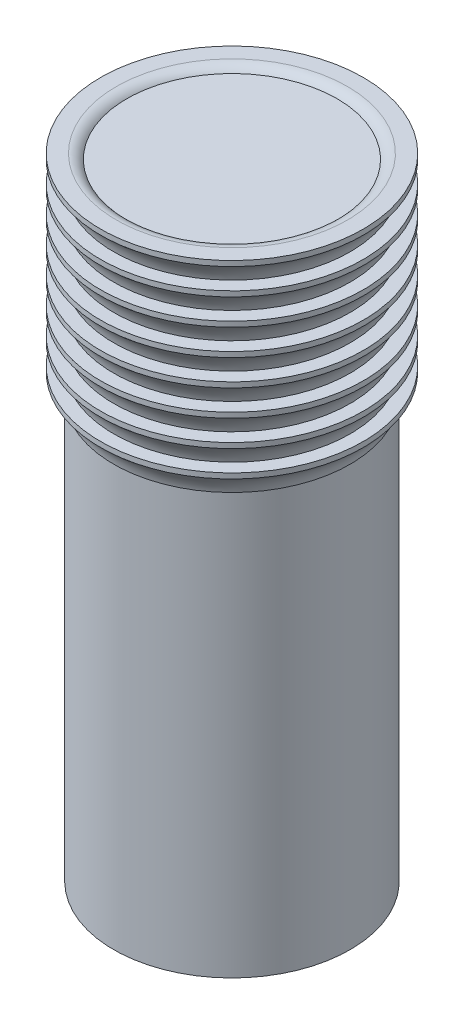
ISO-10303-21;
HEADER;
FILE_DESCRIPTION(('STEP AP214'),'2;1');
FILE_NAME('part.step','',(''),(''),'','','');
FILE_SCHEMA(('AUTOMOTIVE_DESIGN { 1 0 10303 214 1 1 1 1 }'));
ENDSEC;
DATA;
#1=APPLICATION_CONTEXT('core data for automotive mechanical design processes');
#2=APPLICATION_PROTOCOL_DEFINITION('international standard','automotive_design',2000,#1);
#3=PRODUCT_CONTEXT('',#1,'mechanical');
#4=PRODUCT('Part','Part','',(#3));
#5=PRODUCT_RELATED_PRODUCT_CATEGORY('part','',(#4));
#6=PRODUCT_DEFINITION_FORMATION('','',#4);
#7=PRODUCT_DEFINITION_CONTEXT('part definition',#1,'design');
#8=PRODUCT_DEFINITION('design','',#6,#7);
#9=PRODUCT_DEFINITION_SHAPE('','',#8);
#10=(LENGTH_UNIT() NAMED_UNIT(*) SI_UNIT(.MILLI.,.METRE.));
#11=(NAMED_UNIT(*) PLANE_ANGLE_UNIT() SI_UNIT($,.RADIAN.));
#12=(NAMED_UNIT(*) SI_UNIT($,.STERADIAN.) SOLID_ANGLE_UNIT());
#13=UNCERTAINTY_MEASURE_WITH_UNIT(LENGTH_MEASURE(1.E-05),#10,'distance_accuracy_value','');
#14=(GEOMETRIC_REPRESENTATION_CONTEXT(3) GLOBAL_UNCERTAINTY_ASSIGNED_CONTEXT((#13)) GLOBAL_UNIT_ASSIGNED_CONTEXT((#10,
#11,#12)) REPRESENTATION_CONTEXT('',''));
#15=CARTESIAN_POINT('',(0.,0.,0.));
#16=DIRECTION('',(0.,0.,1.));
#17=DIRECTION('',(1.,0.,0.));
#18=AXIS2_PLACEMENT_3D('',#15,#16,#17);
#19=CARTESIAN_POINT('',(0.,-85.,0.));
#20=DIRECTION('',(0.,1.,0.));
#21=DIRECTION('',(0.,0.,1.));
#22=AXIS2_PLACEMENT_3D('',#19,#20,#21);
#23=CYLINDRICAL_SURFACE('',#22,22.5);
#24=CARTESIAN_POINT('',(0.,-85.,0.));
#25=DIRECTION('',(0.,-1.,0.));
#26=DIRECTION('',(0.,0.,-1.));
#27=AXIS2_PLACEMENT_3D('',#24,#25,#26);
#28=CIRCLE('',#27,22.5);
#29=CARTESIAN_POINT('',(0.,-85.,-22.5));
#30=VERTEX_POINT('',#29);
#31=EDGE_CURVE('E11',#30,#30,#28,.T.);
#32=ORIENTED_EDGE('',*,*,#31,.F.);
#33=EDGE_LOOP('',(#32));
#34=FACE_BOUND('',#33,.T.);
#35=CARTESIAN_POINT('',(0.,-5.,0.));
#36=DIRECTION('',(0.,-1.,0.));
#37=DIRECTION('',(0.,0.,-1.));
#38=AXIS2_PLACEMENT_3D('',#35,#36,#37);
#39=CIRCLE('',#38,22.5);
#40=CARTESIAN_POINT('',(0.,-5.,-22.5));
#41=VERTEX_POINT('',#40);
#42=EDGE_CURVE('E55',#41,#41,#39,.T.);
#43=ORIENTED_EDGE('',*,*,#42,.T.);
#44=EDGE_LOOP('',(#43));
#45=FACE_BOUND('',#44,.T.);
#46=ADVANCED_FACE('F52',(#34,#45),#23,.T.);
#47=CARTESIAN_POINT('',(0.,-85.,0.));
#48=DIRECTION('',(0.,-1.,0.));
#49=DIRECTION('',(0.,0.,-1.));
#50=AXIS2_PLACEMENT_3D('',#47,#48,#49);
#51=PLANE('',#50);
#52=ORIENTED_EDGE('',*,*,#31,.T.);
#53=EDGE_LOOP('',(#52));
#54=FACE_BOUND('',#53,.T.);
#55=ADVANCED_FACE('F69',(#54),#51,.T.);
#56=CARTESIAN_POINT('',(0.,-5.,0.));
#57=DIRECTION('',(0.,-1.,0.));
#58=DIRECTION('',(0.,0.,-1.));
#59=AXIS2_PLACEMENT_3D('',#56,#57,#58);
#60=PLANE('',#59);
#61=ORIENTED_EDGE('',*,*,#42,.F.);
#62=EDGE_LOOP('',(#61));
#63=FACE_BOUND('',#62,.T.);
#64=ADVANCED_FACE('F67',(#63),#60,.F.);
#65=CLOSED_SHELL('',(#46,#55,#64));
#66=MANIFOLD_SOLID_BREP('B2',#65);
#67=CARTESIAN_POINT('',(0.,-6.34151617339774,0.));
#68=DIRECTION('',(0.,-1.,0.));
#69=DIRECTION('',(0.,0.,-1.));
#70=AXIS2_PLACEMENT_3D('',#67,#68,#69);
#71=TOROIDAL_SURFACE('',#70,29.0964258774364,6.73145600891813);
#72=CARTESIAN_POINT('',(0.,-1.,0.));
#73=DIRECTION('',(0.,-1.,0.));
#74=DIRECTION('',(0.,0.,-1.));
#75=AXIS2_PLACEMENT_3D('',#72,#73,#74);
#76=CIRCLE('',#75,25.);
#77=CARTESIAN_POINT('',(0.,-1.,-25.));
#78=VERTEX_POINT('',#77);
#79=EDGE_CURVE('E115',#78,#78,#76,.T.);
#80=ORIENTED_EDGE('',*,*,#79,.T.);
#81=EDGE_LOOP('',(#80));
#82=FACE_BOUND('',#81,.T.);
#83=CARTESIAN_POINT('',(0.,-5.,0.));
#84=DIRECTION('',(0.,-1.,0.));
#85=DIRECTION('',(0.,0.,-1.));
#86=AXIS2_PLACEMENT_3D('',#83,#84,#85);
#87=CIRCLE('',#86,22.5);
#88=CARTESIAN_POINT('',(0.,-5.,-22.5));
#89=VERTEX_POINT('',#88);
#90=EDGE_CURVE('E107',#89,#89,#87,.T.);
#91=ORIENTED_EDGE('',*,*,#90,.F.);
#92=EDGE_LOOP('',(#91));
#93=FACE_BOUND('',#92,.T.);
#94=ADVANCED_FACE('F100',(#82,#93),#71,.F.);
#95=CARTESIAN_POINT('',(0.,-5.,0.));
#96=DIRECTION('',(0.,1.,0.));
#97=DIRECTION('',(0.,0.,1.));
#98=AXIS2_PLACEMENT_3D('',#95,#96,#97);
#99=PLANE('',#98);
#100=ORIENTED_EDGE('',*,*,#90,.T.);
#101=EDGE_LOOP('',(#100));
#102=FACE_BOUND('',#101,.T.);
#103=ADVANCED_FACE('F197',(#102),#99,.F.);
#104=CARTESIAN_POINT('',(0.,0.,0.));
#105=DIRECTION('',(0.,-1.,0.));
#106=DIRECTION('',(0.,0.,-1.));
#107=AXIS2_PLACEMENT_3D('',#104,#105,#106);
#108=PLANE('',#107);
#109=CARTESIAN_POINT('',(0.,0.,0.));
#110=DIRECTION('',(0.,-1.,0.));
#111=DIRECTION('',(0.,0.,-1.));
#112=AXIS2_PLACEMENT_3D('',#109,#110,#111);
#113=CIRCLE('',#112,22.5);
#114=CARTESIAN_POINT('',(0.,0.,-22.5));
#115=VERTEX_POINT('',#114);
#116=EDGE_CURVE('E120',#115,#115,#113,.T.);
#117=ORIENTED_EDGE('',*,*,#116,.T.);
#118=EDGE_LOOP('',(#117));
#119=FACE_BOUND('',#118,.T.);
#120=CARTESIAN_POINT('',(0.,0.,0.));
#121=DIRECTION('',(0.,-1.,0.));
#122=DIRECTION('',(0.,0.,-1.));
#123=AXIS2_PLACEMENT_3D('',#120,#121,#122);
#124=CIRCLE('',#123,25.);
#125=CARTESIAN_POINT('',(0.,0.,-25.));
#126=VERTEX_POINT('',#125);
#127=EDGE_CURVE('E111',#126,#126,#124,.T.);
#128=ORIENTED_EDGE('',*,*,#127,.F.);
#129=EDGE_LOOP('',(#128));
#130=FACE_BOUND('',#129,.T.);
#131=ADVANCED_FACE('F202',(#119,#130),#108,.F.);
#132=CARTESIAN_POINT('',(0.,-5.,0.));
#133=DIRECTION('',(0.,-1.,0.));
#134=DIRECTION('',(0.,0.,-1.));
#135=AXIS2_PLACEMENT_3D('',#132,#133,#134);
#136=CYLINDRICAL_SURFACE('',#135,25.);
#137=ORIENTED_EDGE('',*,*,#79,.F.);
#138=EDGE_LOOP('',(#137));
#139=FACE_BOUND('',#138,.T.);
#140=ORIENTED_EDGE('',*,*,#127,.T.);
#141=EDGE_LOOP('',(#140));
#142=FACE_BOUND('',#141,.T.);
#143=ADVANCED_FACE('F208',(#139,#142),#136,.T.);
#144=CARTESIAN_POINT('',(0.,-1.34151617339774,0.));
#145=DIRECTION('',(0.,-1.,0.));
#146=DIRECTION('',(0.,0.,-1.));
#147=AXIS2_PLACEMENT_3D('',#144,#145,#146);
#148=TOROIDAL_SURFACE('',#147,29.0964258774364,6.73145600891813);
#149=CARTESIAN_POINT('',(0.,4.,0.));
#150=DIRECTION('',(0.,-1.,0.));
#151=DIRECTION('',(0.,0.,-1.));
#152=AXIS2_PLACEMENT_3D('',#149,#150,#151);
#153=CIRCLE('',#152,25.);
#154=CARTESIAN_POINT('',(0.,4.,-25.));
#155=VERTEX_POINT('',#154);
#156=EDGE_CURVE('E126',#155,#155,#153,.T.);
#157=ORIENTED_EDGE('',*,*,#156,.T.);
#158=EDGE_LOOP('',(#157));
#159=FACE_BOUND('',#158,.T.);
#160=ORIENTED_EDGE('',*,*,#116,.F.);
#161=EDGE_LOOP('',(#160));
#162=FACE_BOUND('',#161,.T.);
#163=ADVANCED_FACE('F212',(#159,#162),#148,.F.);
#164=CARTESIAN_POINT('',(0.,5.,0.));
#165=DIRECTION('',(0.,-1.,0.));
#166=DIRECTION('',(0.,0.,-1.));
#167=AXIS2_PLACEMENT_3D('',#164,#165,#166);
#168=PLANE('',#167);
#169=CARTESIAN_POINT('',(0.,5.,0.));
#170=DIRECTION('',(0.,-1.,0.));
#171=DIRECTION('',(0.,0.,-1.));
#172=AXIS2_PLACEMENT_3D('',#169,#170,#171);
#173=CIRCLE('',#172,22.5);
#174=CARTESIAN_POINT('',(0.,5.,-22.5));
#175=VERTEX_POINT('',#174);
#176=EDGE_CURVE('E129',#175,#175,#173,.T.);
#177=ORIENTED_EDGE('',*,*,#176,.T.);
#178=EDGE_LOOP('',(#177));
#179=FACE_BOUND('',#178,.T.);
#180=CARTESIAN_POINT('',(0.,5.,0.));
#181=DIRECTION('',(0.,-1.,0.));
#182=DIRECTION('',(0.,0.,-1.));
#183=AXIS2_PLACEMENT_3D('',#180,#181,#182);
#184=CIRCLE('',#183,25.);
#185=CARTESIAN_POINT('',(0.,5.,-25.));
#186=VERTEX_POINT('',#185);
#187=EDGE_CURVE('E123',#186,#186,#184,.T.);
#188=ORIENTED_EDGE('',*,*,#187,.F.);
#189=EDGE_LOOP('',(#188));
#190=FACE_BOUND('',#189,.T.);
#191=ADVANCED_FACE('F216',(#179,#190),#168,.F.);
#192=CARTESIAN_POINT('',(0.,0.,0.));
#193=DIRECTION('',(0.,-1.,0.));
#194=DIRECTION('',(0.,0.,-1.));
#195=AXIS2_PLACEMENT_3D('',#192,#193,#194);
#196=CYLINDRICAL_SURFACE('',#195,25.);
#197=ORIENTED_EDGE('',*,*,#156,.F.);
#198=EDGE_LOOP('',(#197));
#199=FACE_BOUND('',#198,.T.);
#200=ORIENTED_EDGE('',*,*,#187,.T.);
#201=EDGE_LOOP('',(#200));
#202=FACE_BOUND('',#201,.T.);
#203=ADVANCED_FACE('F220',(#199,#202),#196,.T.);
#204=CARTESIAN_POINT('',(0.,3.65848382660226,0.));
#205=DIRECTION('',(0.,-1.,0.));
#206=DIRECTION('',(0.,0.,-1.));
#207=AXIS2_PLACEMENT_3D('',#204,#205,#206);
#208=TOROIDAL_SURFACE('',#207,29.0964258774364,6.73145600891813);
#209=CARTESIAN_POINT('',(0.,9.,0.));
#210=DIRECTION('',(0.,-1.,0.));
#211=DIRECTION('',(0.,0.,-1.));
#212=AXIS2_PLACEMENT_3D('',#209,#210,#211);
#213=CIRCLE('',#212,25.);
#214=CARTESIAN_POINT('',(0.,9.,-25.));
#215=VERTEX_POINT('',#214);
#216=EDGE_CURVE('E135',#215,#215,#213,.T.);
#217=ORIENTED_EDGE('',*,*,#216,.T.);
#218=EDGE_LOOP('',(#217));
#219=FACE_BOUND('',#218,.T.);
#220=ORIENTED_EDGE('',*,*,#176,.F.);
#221=EDGE_LOOP('',(#220));
#222=FACE_BOUND('',#221,.T.);
#223=ADVANCED_FACE('F224',(#219,#222),#208,.F.);
#224=CARTESIAN_POINT('',(0.,10.,0.));
#225=DIRECTION('',(0.,-1.,0.));
#226=DIRECTION('',(0.,0.,-1.));
#227=AXIS2_PLACEMENT_3D('',#224,#225,#226);
#228=PLANE('',#227);
#229=CARTESIAN_POINT('',(0.,9.99999999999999,0.));
#230=DIRECTION('',(0.,-1.,0.));
#231=DIRECTION('',(0.,0.,-1.));
#232=AXIS2_PLACEMENT_3D('',#229,#230,#231);
#233=CIRCLE('',#232,22.5);
#234=CARTESIAN_POINT('',(0.,9.99999999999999,-22.5));
#235=VERTEX_POINT('',#234);
#236=EDGE_CURVE('E138',#235,#235,#233,.T.);
#237=ORIENTED_EDGE('',*,*,#236,.T.);
#238=EDGE_LOOP('',(#237));
#239=FACE_BOUND('',#238,.T.);
#240=CARTESIAN_POINT('',(0.,9.99999999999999,0.));
#241=DIRECTION('',(0.,-1.,0.));
#242=DIRECTION('',(0.,0.,-1.));
#243=AXIS2_PLACEMENT_3D('',#240,#241,#242);
#244=CIRCLE('',#243,25.);
#245=CARTESIAN_POINT('',(0.,9.99999999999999,-25.));
#246=VERTEX_POINT('',#245);
#247=EDGE_CURVE('E132',#246,#246,#244,.T.);
#248=ORIENTED_EDGE('',*,*,#247,.F.);
#249=EDGE_LOOP('',(#248));
#250=FACE_BOUND('',#249,.T.);
#251=ADVANCED_FACE('F228',(#239,#250),#228,.F.);
#252=CARTESIAN_POINT('',(0.,5.,0.));
#253=DIRECTION('',(0.,-1.,0.));
#254=DIRECTION('',(0.,0.,-1.));
#255=AXIS2_PLACEMENT_3D('',#252,#253,#254);
#256=CYLINDRICAL_SURFACE('',#255,25.);
#257=ORIENTED_EDGE('',*,*,#216,.F.);
#258=EDGE_LOOP('',(#257));
#259=FACE_BOUND('',#258,.T.);
#260=ORIENTED_EDGE('',*,*,#247,.T.);
#261=EDGE_LOOP('',(#260));
#262=FACE_BOUND('',#261,.T.);
#263=ADVANCED_FACE('F232',(#259,#262),#256,.T.);
#264=CARTESIAN_POINT('',(0.,8.65848382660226,0.));
#265=DIRECTION('',(0.,-1.,0.));
#266=DIRECTION('',(0.,0.,-1.));
#267=AXIS2_PLACEMENT_3D('',#264,#265,#266);
#268=TOROIDAL_SURFACE('',#267,29.0964258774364,6.73145600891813);
#269=CARTESIAN_POINT('',(0.,14.,0.));
#270=DIRECTION('',(0.,-1.,0.));
#271=DIRECTION('',(0.,0.,-1.));
#272=AXIS2_PLACEMENT_3D('',#269,#270,#271);
#273=CIRCLE('',#272,25.);
#274=CARTESIAN_POINT('',(0.,14.,-25.));
#275=VERTEX_POINT('',#274);
#276=EDGE_CURVE('E144',#275,#275,#273,.T.);
#277=ORIENTED_EDGE('',*,*,#276,.T.);
#278=EDGE_LOOP('',(#277));
#279=FACE_BOUND('',#278,.T.);
#280=ORIENTED_EDGE('',*,*,#236,.F.);
#281=EDGE_LOOP('',(#280));
#282=FACE_BOUND('',#281,.T.);
#283=ADVANCED_FACE('F236',(#279,#282),#268,.F.);
#284=CARTESIAN_POINT('',(0.,15.,0.));
#285=DIRECTION('',(0.,-1.,0.));
#286=DIRECTION('',(0.,0.,-1.));
#287=AXIS2_PLACEMENT_3D('',#284,#285,#286);
#288=PLANE('',#287);
#289=CARTESIAN_POINT('',(0.,15.,0.));
#290=DIRECTION('',(0.,-1.,0.));
#291=DIRECTION('',(0.,0.,-1.));
#292=AXIS2_PLACEMENT_3D('',#289,#290,#291);
#293=CIRCLE('',#292,22.5);
#294=CARTESIAN_POINT('',(0.,15.,-22.5));
#295=VERTEX_POINT('',#294);
#296=EDGE_CURVE('E147',#295,#295,#293,.T.);
#297=ORIENTED_EDGE('',*,*,#296,.T.);
#298=EDGE_LOOP('',(#297));
#299=FACE_BOUND('',#298,.T.);
#300=CARTESIAN_POINT('',(0.,15.,0.));
#301=DIRECTION('',(0.,-1.,0.));
#302=DIRECTION('',(0.,0.,-1.));
#303=AXIS2_PLACEMENT_3D('',#300,#301,#302);
#304=CIRCLE('',#303,25.);
#305=CARTESIAN_POINT('',(0.,15.,-25.));
#306=VERTEX_POINT('',#305);
#307=EDGE_CURVE('E141',#306,#306,#304,.T.);
#308=ORIENTED_EDGE('',*,*,#307,.F.);
#309=EDGE_LOOP('',(#308));
#310=FACE_BOUND('',#309,.T.);
#311=ADVANCED_FACE('F240',(#299,#310),#288,.F.);
#312=CARTESIAN_POINT('',(0.,10.,0.));
#313=DIRECTION('',(0.,-1.,0.));
#314=DIRECTION('',(0.,0.,-1.));
#315=AXIS2_PLACEMENT_3D('',#312,#313,#314);
#316=CYLINDRICAL_SURFACE('',#315,25.);
#317=ORIENTED_EDGE('',*,*,#276,.F.);
#318=EDGE_LOOP('',(#317));
#319=FACE_BOUND('',#318,.T.);
#320=ORIENTED_EDGE('',*,*,#307,.T.);
#321=EDGE_LOOP('',(#320));
#322=FACE_BOUND('',#321,.T.);
#323=ADVANCED_FACE('F244',(#319,#322),#316,.T.);
#324=CARTESIAN_POINT('',(0.,13.6584838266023,0.));
#325=DIRECTION('',(0.,-1.,0.));
#326=DIRECTION('',(0.,0.,-1.));
#327=AXIS2_PLACEMENT_3D('',#324,#325,#326);
#328=TOROIDAL_SURFACE('',#327,29.0964258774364,6.73145600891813);
#329=CARTESIAN_POINT('',(0.,19.,0.));
#330=DIRECTION('',(0.,-1.,0.));
#331=DIRECTION('',(0.,0.,-1.));
#332=AXIS2_PLACEMENT_3D('',#329,#330,#331);
#333=CIRCLE('',#332,25.);
#334=CARTESIAN_POINT('',(0.,19.,-25.));
#335=VERTEX_POINT('',#334);
#336=EDGE_CURVE('E153',#335,#335,#333,.T.);
#337=ORIENTED_EDGE('',*,*,#336,.T.);
#338=EDGE_LOOP('',(#337));
#339=FACE_BOUND('',#338,.T.);
#340=ORIENTED_EDGE('',*,*,#296,.F.);
#341=EDGE_LOOP('',(#340));
#342=FACE_BOUND('',#341,.T.);
#343=ADVANCED_FACE('F248',(#339,#342),#328,.F.);
#344=CARTESIAN_POINT('',(0.,20.,0.));
#345=DIRECTION('',(0.,-1.,0.));
#346=DIRECTION('',(0.,0.,-1.));
#347=AXIS2_PLACEMENT_3D('',#344,#345,#346);
#348=PLANE('',#347);
#349=CARTESIAN_POINT('',(0.,20.,0.));
#350=DIRECTION('',(0.,-1.,0.));
#351=DIRECTION('',(0.,0.,-1.));
#352=AXIS2_PLACEMENT_3D('',#349,#350,#351);
#353=CIRCLE('',#352,22.5);
#354=CARTESIAN_POINT('',(0.,20.,-22.5));
#355=VERTEX_POINT('',#354);
#356=EDGE_CURVE('E156',#355,#355,#353,.T.);
#357=ORIENTED_EDGE('',*,*,#356,.T.);
#358=EDGE_LOOP('',(#357));
#359=FACE_BOUND('',#358,.T.);
#360=CARTESIAN_POINT('',(0.,20.,0.));
#361=DIRECTION('',(0.,-1.,0.));
#362=DIRECTION('',(0.,0.,-1.));
#363=AXIS2_PLACEMENT_3D('',#360,#361,#362);
#364=CIRCLE('',#363,25.);
#365=CARTESIAN_POINT('',(0.,20.,-25.));
#366=VERTEX_POINT('',#365);
#367=EDGE_CURVE('E150',#366,#366,#364,.T.);
#368=ORIENTED_EDGE('',*,*,#367,.F.);
#369=EDGE_LOOP('',(#368));
#370=FACE_BOUND('',#369,.T.);
#371=ADVANCED_FACE('F252',(#359,#370),#348,.F.);
#372=CARTESIAN_POINT('',(0.,15.,0.));
#373=DIRECTION('',(0.,-1.,0.));
#374=DIRECTION('',(0.,0.,-1.));
#375=AXIS2_PLACEMENT_3D('',#372,#373,#374);
#376=CYLINDRICAL_SURFACE('',#375,25.);
#377=ORIENTED_EDGE('',*,*,#336,.F.);
#378=EDGE_LOOP('',(#377));
#379=FACE_BOUND('',#378,.T.);
#380=ORIENTED_EDGE('',*,*,#367,.T.);
#381=EDGE_LOOP('',(#380));
#382=FACE_BOUND('',#381,.T.);
#383=ADVANCED_FACE('F256',(#379,#382),#376,.T.);
#384=CARTESIAN_POINT('',(0.,18.6584838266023,0.));
#385=DIRECTION('',(0.,-1.,0.));
#386=DIRECTION('',(0.,0.,-1.));
#387=AXIS2_PLACEMENT_3D('',#384,#385,#386);
#388=TOROIDAL_SURFACE('',#387,29.0964258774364,6.73145600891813);
#389=CARTESIAN_POINT('',(0.,24.,0.));
#390=DIRECTION('',(0.,-1.,0.));
#391=DIRECTION('',(0.,0.,-1.));
#392=AXIS2_PLACEMENT_3D('',#389,#390,#391);
#393=CIRCLE('',#392,25.);
#394=CARTESIAN_POINT('',(0.,24.,-25.));
#395=VERTEX_POINT('',#394);
#396=EDGE_CURVE('E162',#395,#395,#393,.T.);
#397=ORIENTED_EDGE('',*,*,#396,.T.);
#398=EDGE_LOOP('',(#397));
#399=FACE_BOUND('',#398,.T.);
#400=ORIENTED_EDGE('',*,*,#356,.F.);
#401=EDGE_LOOP('',(#400));
#402=FACE_BOUND('',#401,.T.);
#403=ADVANCED_FACE('F260',(#399,#402),#388,.F.);
#404=CARTESIAN_POINT('',(0.,25.,0.));
#405=DIRECTION('',(0.,-1.,0.));
#406=DIRECTION('',(0.,0.,-1.));
#407=AXIS2_PLACEMENT_3D('',#404,#405,#406);
#408=PLANE('',#407);
#409=CARTESIAN_POINT('',(0.,25.,0.));
#410=DIRECTION('',(0.,-1.,0.));
#411=DIRECTION('',(0.,0.,-1.));
#412=AXIS2_PLACEMENT_3D('',#409,#410,#411);
#413=CIRCLE('',#412,22.5);
#414=CARTESIAN_POINT('',(0.,25.,-22.5));
#415=VERTEX_POINT('',#414);
#416=EDGE_CURVE('E165',#415,#415,#413,.T.);
#417=ORIENTED_EDGE('',*,*,#416,.T.);
#418=EDGE_LOOP('',(#417));
#419=FACE_BOUND('',#418,.T.);
#420=CARTESIAN_POINT('',(0.,25.,0.));
#421=DIRECTION('',(0.,-1.,0.));
#422=DIRECTION('',(0.,0.,-1.));
#423=AXIS2_PLACEMENT_3D('',#420,#421,#422);
#424=CIRCLE('',#423,25.);
#425=CARTESIAN_POINT('',(0.,25.,-25.));
#426=VERTEX_POINT('',#425);
#427=EDGE_CURVE('E159',#426,#426,#424,.T.);
#428=ORIENTED_EDGE('',*,*,#427,.F.);
#429=EDGE_LOOP('',(#428));
#430=FACE_BOUND('',#429,.T.);
#431=ADVANCED_FACE('F264',(#419,#430),#408,.F.);
#432=CARTESIAN_POINT('',(0.,20.,0.));
#433=DIRECTION('',(0.,-1.,0.));
#434=DIRECTION('',(0.,0.,-1.));
#435=AXIS2_PLACEMENT_3D('',#432,#433,#434);
#436=CYLINDRICAL_SURFACE('',#435,25.);
#437=ORIENTED_EDGE('',*,*,#396,.F.);
#438=EDGE_LOOP('',(#437));
#439=FACE_BOUND('',#438,.T.);
#440=ORIENTED_EDGE('',*,*,#427,.T.);
#441=EDGE_LOOP('',(#440));
#442=FACE_BOUND('',#441,.T.);
#443=ADVANCED_FACE('F268',(#439,#442),#436,.T.);
#444=CARTESIAN_POINT('',(0.,23.6584838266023,0.));
#445=DIRECTION('',(0.,-1.,0.));
#446=DIRECTION('',(0.,0.,-1.));
#447=AXIS2_PLACEMENT_3D('',#444,#445,#446);
#448=TOROIDAL_SURFACE('',#447,29.0964258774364,6.73145600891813);
#449=CARTESIAN_POINT('',(0.,29.,0.));
#450=DIRECTION('',(0.,-1.,0.));
#451=DIRECTION('',(0.,0.,-1.));
#452=AXIS2_PLACEMENT_3D('',#449,#450,#451);
#453=CIRCLE('',#452,25.);
#454=CARTESIAN_POINT('',(0.,29.,-25.));
#455=VERTEX_POINT('',#454);
#456=EDGE_CURVE('E171',#455,#455,#453,.T.);
#457=ORIENTED_EDGE('',*,*,#456,.T.);
#458=EDGE_LOOP('',(#457));
#459=FACE_BOUND('',#458,.T.);
#460=ORIENTED_EDGE('',*,*,#416,.F.);
#461=EDGE_LOOP('',(#460));
#462=FACE_BOUND('',#461,.T.);
#463=ADVANCED_FACE('F272',(#459,#462),#448,.F.);
#464=CARTESIAN_POINT('',(0.,30.,0.));
#465=DIRECTION('',(0.,-1.,0.));
#466=DIRECTION('',(0.,0.,-1.));
#467=AXIS2_PLACEMENT_3D('',#464,#465,#466);
#468=PLANE('',#467);
#469=CARTESIAN_POINT('',(0.,30.,0.));
#470=DIRECTION('',(0.,-1.,0.));
#471=DIRECTION('',(0.,0.,-1.));
#472=AXIS2_PLACEMENT_3D('',#469,#470,#471);
#473=CIRCLE('',#472,22.5);
#474=CARTESIAN_POINT('',(0.,30.,-22.5));
#475=VERTEX_POINT('',#474);
#476=EDGE_CURVE('E174',#475,#475,#473,.T.);
#477=ORIENTED_EDGE('',*,*,#476,.T.);
#478=EDGE_LOOP('',(#477));
#479=FACE_BOUND('',#478,.T.);
#480=CARTESIAN_POINT('',(0.,30.,0.));
#481=DIRECTION('',(0.,-1.,0.));
#482=DIRECTION('',(0.,0.,-1.));
#483=AXIS2_PLACEMENT_3D('',#480,#481,#482);
#484=CIRCLE('',#483,25.);
#485=CARTESIAN_POINT('',(0.,30.,-25.));
#486=VERTEX_POINT('',#485);
#487=EDGE_CURVE('E168',#486,#486,#484,.T.);
#488=ORIENTED_EDGE('',*,*,#487,.F.);
#489=EDGE_LOOP('',(#488));
#490=FACE_BOUND('',#489,.T.);
#491=ADVANCED_FACE('F276',(#479,#490),#468,.F.);
#492=CARTESIAN_POINT('',(0.,25.,0.));
#493=DIRECTION('',(0.,-1.,0.));
#494=DIRECTION('',(0.,0.,-1.));
#495=AXIS2_PLACEMENT_3D('',#492,#493,#494);
#496=CYLINDRICAL_SURFACE('',#495,25.);
#497=ORIENTED_EDGE('',*,*,#456,.F.);
#498=EDGE_LOOP('',(#497));
#499=FACE_BOUND('',#498,.T.);
#500=ORIENTED_EDGE('',*,*,#487,.T.);
#501=EDGE_LOOP('',(#500));
#502=FACE_BOUND('',#501,.T.);
#503=ADVANCED_FACE('F280',(#499,#502),#496,.T.);
#504=CARTESIAN_POINT('',(0.,28.6584838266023,0.));
#505=DIRECTION('',(0.,-1.,0.));
#506=DIRECTION('',(0.,0.,-1.));
#507=AXIS2_PLACEMENT_3D('',#504,#505,#506);
#508=TOROIDAL_SURFACE('',#507,29.0964258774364,6.73145600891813);
#509=CARTESIAN_POINT('',(0.,34.,0.));
#510=DIRECTION('',(0.,-1.,0.));
#511=DIRECTION('',(0.,0.,-1.));
#512=AXIS2_PLACEMENT_3D('',#509,#510,#511);
#513=CIRCLE('',#512,25.);
#514=CARTESIAN_POINT('',(0.,34.,-25.));
#515=VERTEX_POINT('',#514);
#516=EDGE_CURVE('E180',#515,#515,#513,.T.);
#517=ORIENTED_EDGE('',*,*,#516,.T.);
#518=EDGE_LOOP('',(#517));
#519=FACE_BOUND('',#518,.T.);
#520=ORIENTED_EDGE('',*,*,#476,.F.);
#521=EDGE_LOOP('',(#520));
#522=FACE_BOUND('',#521,.T.);
#523=ADVANCED_FACE('F284',(#519,#522),#508,.F.);
#524=CARTESIAN_POINT('',(0.,35.,0.));
#525=DIRECTION('',(0.,-1.,0.));
#526=DIRECTION('',(0.,0.,-1.));
#527=AXIS2_PLACEMENT_3D('',#524,#525,#526);
#528=PLANE('',#527);
#529=CARTESIAN_POINT('',(0.,35.,0.));
#530=DIRECTION('',(0.,-1.,0.));
#531=DIRECTION('',(0.,0.,-1.));
#532=AXIS2_PLACEMENT_3D('',#529,#530,#531);
#533=CIRCLE('',#532,22.);
#534=CARTESIAN_POINT('',(0.,35.,-22.));
#535=VERTEX_POINT('',#534);
#536=EDGE_CURVE('E51',#535,#535,#533,.T.);
#537=ORIENTED_EDGE('',*,*,#536,.T.);
#538=EDGE_LOOP('',(#537));
#539=FACE_BOUND('',#538,.T.);
#540=CARTESIAN_POINT('',(0.,35.,0.));
#541=DIRECTION('',(0.,-1.,0.));
#542=DIRECTION('',(0.,0.,-1.));
#543=AXIS2_PLACEMENT_3D('',#540,#541,#542);
#544=CIRCLE('',#543,25.);
#545=CARTESIAN_POINT('',(0.,35.,-25.));
#546=VERTEX_POINT('',#545);
#547=EDGE_CURVE('E177',#546,#546,#544,.T.);
#548=ORIENTED_EDGE('',*,*,#547,.F.);
#549=EDGE_LOOP('',(#548));
#550=FACE_BOUND('',#549,.T.);
#551=ADVANCED_FACE('F288',(#539,#550),#528,.F.);
#552=CARTESIAN_POINT('',(0.,30.,0.));
#553=DIRECTION('',(0.,-1.,0.));
#554=DIRECTION('',(0.,0.,-1.));
#555=AXIS2_PLACEMENT_3D('',#552,#553,#554);
#556=CYLINDRICAL_SURFACE('',#555,25.);
#557=ORIENTED_EDGE('',*,*,#516,.F.);
#558=EDGE_LOOP('',(#557));
#559=FACE_BOUND('',#558,.T.);
#560=ORIENTED_EDGE('',*,*,#547,.T.);
#561=EDGE_LOOP('',(#560));
#562=FACE_BOUND('',#561,.T.);
#563=ADVANCED_FACE('F194',(#559,#562),#556,.T.);
#564=CARTESIAN_POINT('',(0.,34.,0.));
#565=DIRECTION('',(0.,1.,0.));
#566=DIRECTION('',(0.,0.,1.));
#567=AXIS2_PLACEMENT_3D('',#564,#565,#566);
#568=PLANE('',#567);
#569=CARTESIAN_POINT('',(0.,34.,0.));
#570=DIRECTION('',(0.,1.,0.));
#571=DIRECTION('',(0.,0.,1.));
#572=AXIS2_PLACEMENT_3D('',#569,#570,#571);
#573=CIRCLE('',#572,20.);
#574=CARTESIAN_POINT('',(0.,34.,20.));
#575=VERTEX_POINT('',#574);
#576=EDGE_CURVE('E183',#575,#575,#573,.T.);
#577=ORIENTED_EDGE('',*,*,#576,.T.);
#578=EDGE_LOOP('',(#577));
#579=FACE_BOUND('',#578,.T.);
#580=ADVANCED_FACE('F187',(#579),#568,.T.);
#581=CARTESIAN_POINT('',(0.,32.5,0.));
#582=DIRECTION('',(0.,-1.,0.));
#583=DIRECTION('',(0.,0.,-1.));
#584=AXIS2_PLACEMENT_3D('',#581,#582,#583);
#585=TOROIDAL_SURFACE('',#584,22.,2.5);
#586=ORIENTED_EDGE('',*,*,#536,.F.);
#587=EDGE_LOOP('',(#586));
#588=FACE_BOUND('',#587,.T.);
#589=ORIENTED_EDGE('',*,*,#576,.F.);
#590=EDGE_LOOP('',(#589));
#591=FACE_BOUND('',#590,.T.);
#592=ADVANCED_FACE('F102',(#588,#591),#585,.T.);
#593=CLOSED_SHELL('',(#94,#103,#131,#143,#163,#191,#203,#223,#251,#263,#283,#311,#323,#343,#371,
#383,#403,#431,#443,#463,#491,#503,#523,#551,#563,#580,#592));
#594=MANIFOLD_SOLID_BREP('B6',#593);
#595=ADVANCED_BREP_SHAPE_REPRESENTATION('',(#18,#66,#594),#14);
#596=SHAPE_DEFINITION_REPRESENTATION(#9,#595);
ENDSEC;
END-ISO-10303-21;
